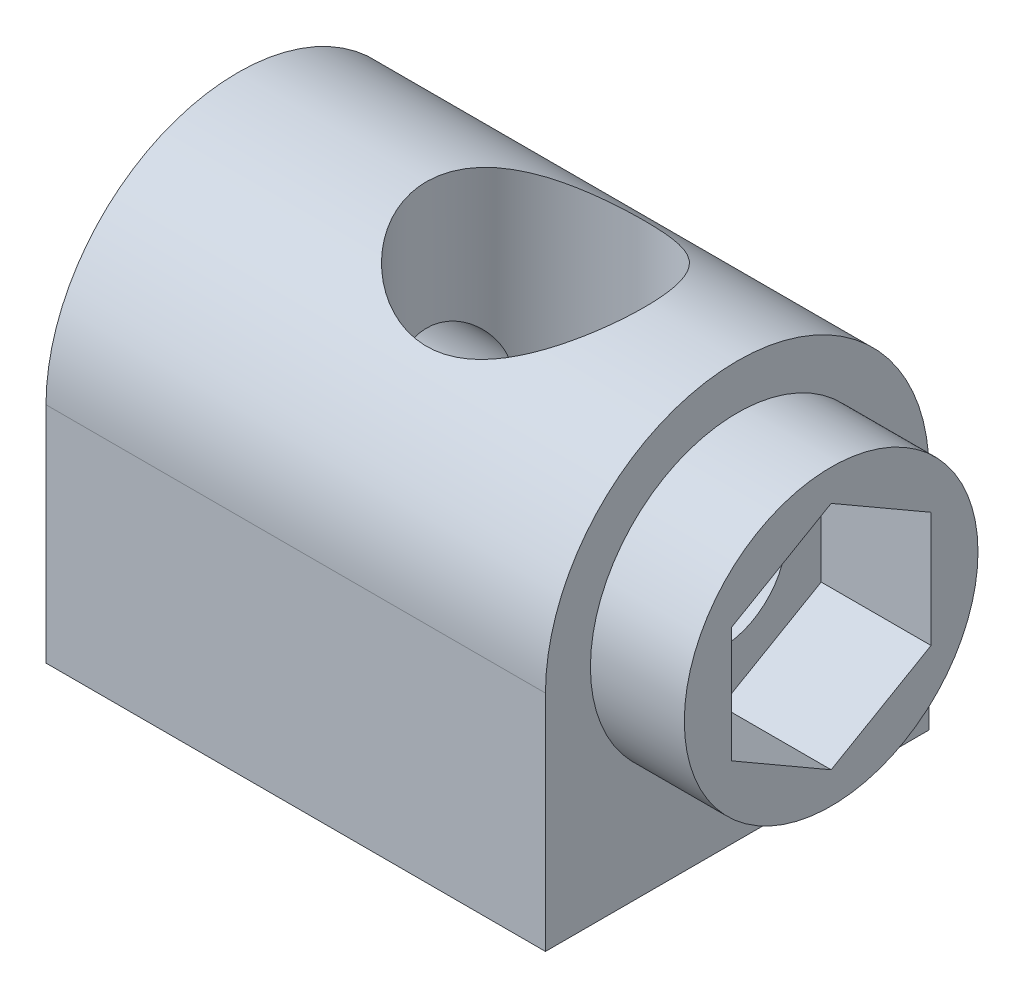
ISO-10303-21;
HEADER;
FILE_DESCRIPTION(('STEP AP214'),'2;1');
FILE_NAME('part.step','',(''),(''),'','','');
FILE_SCHEMA(('AUTOMOTIVE_DESIGN { 1 0 10303 214 1 1 1 1 }'));
ENDSEC;
DATA;
#1=APPLICATION_CONTEXT('core data for automotive mechanical design processes');
#2=APPLICATION_PROTOCOL_DEFINITION('international standard','automotive_design',2000,#1);
#3=PRODUCT_CONTEXT('',#1,'mechanical');
#4=PRODUCT('Part','Part','',(#3));
#5=PRODUCT_RELATED_PRODUCT_CATEGORY('part','',(#4));
#6=PRODUCT_DEFINITION_FORMATION('','',#4);
#7=PRODUCT_DEFINITION_CONTEXT('part definition',#1,'design');
#8=PRODUCT_DEFINITION('design','',#6,#7);
#9=PRODUCT_DEFINITION_SHAPE('','',#8);
#10=(LENGTH_UNIT() NAMED_UNIT(*) SI_UNIT(.MILLI.,.METRE.));
#11=(NAMED_UNIT(*) PLANE_ANGLE_UNIT() SI_UNIT($,.RADIAN.));
#12=(NAMED_UNIT(*) SI_UNIT($,.STERADIAN.) SOLID_ANGLE_UNIT());
#13=UNCERTAINTY_MEASURE_WITH_UNIT(LENGTH_MEASURE(1.E-05),#10,'distance_accuracy_value','');
#14=(GEOMETRIC_REPRESENTATION_CONTEXT(3) GLOBAL_UNCERTAINTY_ASSIGNED_CONTEXT((#13)) GLOBAL_UNIT_ASSIGNED_CONTEXT((#10,
#11,#12)) REPRESENTATION_CONTEXT('',''));
#15=CARTESIAN_POINT('',(0.,0.,0.));
#16=DIRECTION('',(0.,0.,1.));
#17=DIRECTION('',(1.,0.,0.));
#18=AXIS2_PLACEMENT_3D('',#15,#16,#17);
#19=CARTESIAN_POINT('',(25.,0.,9.6));
#20=DIRECTION('',(0.,1.,0.));
#21=DIRECTION('',(0.,0.,1.));
#22=AXIS2_PLACEMENT_3D('',#19,#20,#21);
#23=PLANE('',#22);
#24=DIRECTION('',(0.,0.,-1.));
#25=VECTOR('',#24,1.);
#26=CARTESIAN_POINT('',(3.,0.,4.));
#27=LINE('',#26,#25);
#28=CARTESIAN_POINT('',(3.,0.,4.));
#29=VERTEX_POINT('',#28);
#30=CARTESIAN_POINT('',(3.,0.,-4.));
#31=VERTEX_POINT('',#30);
#32=EDGE_CURVE('E190',#29,#31,#27,.T.);
#33=ORIENTED_EDGE('',*,*,#32,.F.);
#34=DIRECTION('',(-1.,0.,0.));
#35=VECTOR('',#34,1.);
#36=CARTESIAN_POINT('',(3.,0.,4.));
#37=LINE('',#36,#35);
#38=CARTESIAN_POINT('',(11.,0.,4.));
#39=VERTEX_POINT('',#38);
#40=EDGE_CURVE('E203',#39,#29,#37,.T.);
#41=ORIENTED_EDGE('',*,*,#40,.F.);
#42=DIRECTION('',(0.,0.,1.));
#43=VECTOR('',#42,1.);
#44=CARTESIAN_POINT('',(11.,0.,4.));
#45=LINE('',#44,#43);
#46=CARTESIAN_POINT('',(11.,0.,-4.));
#47=VERTEX_POINT('',#46);
#48=EDGE_CURVE('E212',#47,#39,#45,.T.);
#49=ORIENTED_EDGE('',*,*,#48,.F.);
#50=DIRECTION('',(1.,0.,0.));
#51=VECTOR('',#50,1.);
#52=CARTESIAN_POINT('',(3.,0.,-4.));
#53=LINE('',#52,#51);
#54=EDGE_CURVE('E193',#31,#47,#53,.T.);
#55=ORIENTED_EDGE('',*,*,#54,.F.);
#56=EDGE_LOOP('',(#33,#41,#49,#55));
#57=FACE_BOUND('',#56,.T.);
#58=CARTESIAN_POINT('',(14.9,0.,0.));
#59=DIRECTION('',(0.,-1.,0.));
#60=DIRECTION('',(0.,0.,-1.));
#61=AXIS2_PLACEMENT_3D('',#58,#59,#60);
#62=CIRCLE('',#61,3.4);
#63=CARTESIAN_POINT('',(14.9,0.,-3.4));
#64=VERTEX_POINT('',#63);
#65=EDGE_CURVE('E379',#64,#64,#62,.T.);
#66=ORIENTED_EDGE('',*,*,#65,.F.);
#67=EDGE_LOOP('',(#66));
#68=FACE_BOUND('',#67,.T.);
#69=DIRECTION('',(0.,0.,-1.));
#70=VECTOR('',#69,1.);
#71=CARTESIAN_POINT('',(0.,0.,9.6));
#72=LINE('',#71,#70);
#73=CARTESIAN_POINT('',(0.,0.,9.6));
#74=VERTEX_POINT('',#73);
#75=CARTESIAN_POINT('',(0.,0.,-9.6));
#76=VERTEX_POINT('',#75);
#77=EDGE_CURVE('E340',#74,#76,#72,.T.);
#78=ORIENTED_EDGE('',*,*,#77,.T.);
#79=DIRECTION('',(-1.,0.,0.));
#80=VECTOR('',#79,1.);
#81=CARTESIAN_POINT('',(25.,0.,-9.6));
#82=LINE('',#81,#80);
#83=CARTESIAN_POINT('',(25.,0.,-9.6));
#84=VERTEX_POINT('',#83);
#85=EDGE_CURVE('E347',#84,#76,#82,.T.);
#86=ORIENTED_EDGE('',*,*,#85,.F.);
#87=DIRECTION('',(0.,0.,-1.));
#88=VECTOR('',#87,1.);
#89=CARTESIAN_POINT('',(25.,0.,9.6));
#90=LINE('',#89,#88);
#91=CARTESIAN_POINT('',(25.,0.,9.6));
#92=VERTEX_POINT('',#91);
#93=EDGE_CURVE('E346',#92,#84,#90,.T.);
#94=ORIENTED_EDGE('',*,*,#93,.F.);
#95=DIRECTION('',(-1.,0.,0.));
#96=VECTOR('',#95,1.);
#97=CARTESIAN_POINT('',(25.,0.,9.6));
#98=LINE('',#97,#96);
#99=EDGE_CURVE('E334',#92,#74,#98,.T.);
#100=ORIENTED_EDGE('',*,*,#99,.T.);
#101=EDGE_LOOP('',(#78,#86,#94,#100));
#102=FACE_BOUND('',#101,.T.);
#103=DIRECTION('',(0.,0.,-1.));
#104=VECTOR('',#103,1.);
#105=CARTESIAN_POINT('',(19.,0.,4.));
#106=LINE('',#105,#104);
#107=CARTESIAN_POINT('',(19.,0.,4.));
#108=VERTEX_POINT('',#107);
#109=CARTESIAN_POINT('',(19.,0.,-4.));
#110=VERTEX_POINT('',#109);
#111=EDGE_CURVE('E189',#108,#110,#106,.T.);
#112=ORIENTED_EDGE('',*,*,#111,.F.);
#113=DIRECTION('',(-1.,0.,0.));
#114=VECTOR('',#113,1.);
#115=CARTESIAN_POINT('',(19.,0.,4.));
#116=LINE('',#115,#114);
#117=CARTESIAN_POINT('',(21.8,0.,4.));
#118=VERTEX_POINT('',#117);
#119=EDGE_CURVE('E186',#118,#108,#116,.T.);
#120=ORIENTED_EDGE('',*,*,#119,.F.);
#121=DIRECTION('',(0.,0.,1.));
#122=VECTOR('',#121,1.);
#123=CARTESIAN_POINT('',(21.8,0.,4.));
#124=LINE('',#123,#122);
#125=CARTESIAN_POINT('',(21.8,0.,-4.));
#126=VERTEX_POINT('',#125);
#127=EDGE_CURVE('E64',#126,#118,#124,.T.);
#128=ORIENTED_EDGE('',*,*,#127,.F.);
#129=DIRECTION('',(1.,0.,0.));
#130=VECTOR('',#129,1.);
#131=CARTESIAN_POINT('',(19.,0.,-4.));
#132=LINE('',#131,#130);
#133=EDGE_CURVE('E59',#110,#126,#132,.T.);
#134=ORIENTED_EDGE('',*,*,#133,.F.);
#135=EDGE_LOOP('',(#112,#120,#128,#134));
#136=FACE_BOUND('',#135,.T.);
#137=ADVANCED_FACE('F37',(#57,#68,#102,#136),#23,.F.);
#138=CARTESIAN_POINT('',(29.7,11.2,0.));
#139=DIRECTION('',(-1.,0.,0.));
#140=DIRECTION('',(0.,0.,1.));
#141=AXIS2_PLACEMENT_3D('',#138,#139,#140);
#142=CYLINDRICAL_SURFACE('',#141,3.25);
#143=CARTESIAN_POINT('',(19.2749285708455,11.2,3.25));
#144=CARTESIAN_POINT('',(19.2749279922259,11.2818703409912,3.25000040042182));
#145=CARTESIAN_POINT('',(19.2772351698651,11.3637361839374,3.2469018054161));
#146=CARTESIAN_POINT('',(19.286360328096,11.5267799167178,3.23456361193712));
#147=CARTESIAN_POINT('',(19.293180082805,11.6079575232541,3.22532159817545));
#148=CARTESIAN_POINT('',(19.3110451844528,11.7689675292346,3.20084502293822));
#149=CARTESIAN_POINT('',(19.3220925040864,11.8487992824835,3.18560766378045));
#150=CARTESIAN_POINT('',(19.34796906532,12.0065330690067,3.14937518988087));
#151=CARTESIAN_POINT('',(19.36280009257,12.0844341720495,3.12837735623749));
#152=CARTESIAN_POINT('',(19.4119280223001,12.3133472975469,3.05749971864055));
#153=CARTESIAN_POINT('',(19.4510232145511,12.4609060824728,2.99952608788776));
#154=CARTESIAN_POINT('',(19.5374250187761,12.7440147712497,2.86412627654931));
#155=CARTESIAN_POINT('',(19.5847341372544,12.8795609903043,2.78669415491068));
#156=CARTESIAN_POINT('',(19.6891417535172,13.1528665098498,2.60365031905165));
#157=CARTESIAN_POINT('',(19.7467327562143,13.28892102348,2.49576626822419));
#158=CARTESIAN_POINT('',(19.8612547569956,13.542401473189,2.25958661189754));
#159=CARTESIAN_POINT('',(19.9181852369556,13.6598135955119,2.13127601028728));
#160=CARTESIAN_POINT('',(20.0321784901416,13.8850850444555,1.84117132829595));
#161=CARTESIAN_POINT('',(20.0886128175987,13.9906044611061,1.67726823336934));
#162=CARTESIAN_POINT('',(20.1633182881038,14.126418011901,1.41710504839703));
#163=CARTESIAN_POINT('',(20.1865680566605,14.1679542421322,1.32796963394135));
#164=CARTESIAN_POINT('',(20.2290779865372,14.2430307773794,1.14550143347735));
#165=CARTESIAN_POINT('',(20.2483407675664,14.2765763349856,1.05217145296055));
#166=CARTESIAN_POINT('',(20.2806586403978,14.332403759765,0.871016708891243));
#167=CARTESIAN_POINT('',(20.2941271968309,14.355448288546,0.783499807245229));
#168=CARTESIAN_POINT('',(20.3168977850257,14.3942179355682,0.606370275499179));
#169=CARTESIAN_POINT('',(20.3262021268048,14.4099471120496,0.516758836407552));
#170=CARTESIAN_POINT('',(20.340371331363,14.4338420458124,0.336224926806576));
#171=CARTESIAN_POINT('',(20.3452385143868,14.442011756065,0.245303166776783));
#172=CARTESIAN_POINT('',(20.3504005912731,14.4506727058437,0.062996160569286));
#173=CARTESIAN_POINT('',(20.3506959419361,14.4511647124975,-0.0283890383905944));
#174=CARTESIAN_POINT('',(20.3451653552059,14.4418954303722,-0.279558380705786));
#175=CARTESIAN_POINT('',(20.3345630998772,14.4241352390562,-0.439035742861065));
#176=CARTESIAN_POINT('',(20.3001526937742,14.3657838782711,-0.752154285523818));
#177=CARTESIAN_POINT('',(20.2763435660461,14.3251910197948,-0.905795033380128));
#178=CARTESIAN_POINT('',(20.2174152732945,14.2226930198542,-1.20454209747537));
#179=CARTESIAN_POINT('',(20.182226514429,14.1606565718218,-1.34958922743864));
#180=CARTESIAN_POINT('',(20.1033622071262,14.0175413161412,-1.62739400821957));
#181=CARTESIAN_POINT('',(20.0596844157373,13.936457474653,-1.76014839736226));
#182=CARTESIAN_POINT('',(19.9614505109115,13.746693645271,-2.0264926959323));
#183=CARTESIAN_POINT('',(19.9062185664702,13.6358807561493,-2.15831247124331));
#184=CARTESIAN_POINT('',(19.7936809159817,13.3953188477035,-2.40260742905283));
#185=CARTESIAN_POINT('',(19.7363725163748,13.2655445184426,-2.51505631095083));
#186=CARTESIAN_POINT('',(19.6185240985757,12.9732398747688,-2.73033396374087));
#187=CARTESIAN_POINT('',(19.5583581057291,12.8086626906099,-2.83061308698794));
#188=CARTESIAN_POINT('',(19.450124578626,12.4612073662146,-3.00152600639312));
#189=CARTESIAN_POINT('',(19.4020348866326,12.2783636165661,-3.0722142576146));
#190=CARTESIAN_POINT('',(19.3357826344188,11.9455501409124,-3.16682986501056));
#191=CARTESIAN_POINT('',(19.3131726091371,11.7985184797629,-3.19797420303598));
#192=CARTESIAN_POINT('',(19.2827099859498,11.5001198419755,-3.23960680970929));
#193=CARTESIAN_POINT('',(19.2748406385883,11.3487579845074,-3.2501185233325));
#194=CARTESIAN_POINT('',(19.2750181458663,11.0458751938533,-3.2498792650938));
#195=CARTESIAN_POINT('',(19.2830852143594,10.8943543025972,-3.23910128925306));
#196=CARTESIAN_POINT('',(19.3139570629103,10.5957265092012,-3.19689491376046));
#197=CARTESIAN_POINT('',(19.3367733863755,10.4486231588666,-3.16545033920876));
#198=CARTESIAN_POINT('',(19.3941296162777,10.1622349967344,-3.08346728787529));
#199=CARTESIAN_POINT('',(19.4286781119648,10.0229560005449,-3.03291481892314));
#200=CARTESIAN_POINT('',(19.5057786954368,9.75439244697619,-2.91449628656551));
#201=CARTESIAN_POINT('',(19.5483338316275,9.62511172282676,-2.84662362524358));
#202=CARTESIAN_POINT('',(19.6458194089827,9.35574425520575,-2.68149744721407));
#203=CARTESIAN_POINT('',(19.7016026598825,9.21785131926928,-2.58116151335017));
#204=CARTESIAN_POINT('',(19.8139062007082,8.959458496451,-2.36038558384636));
#205=CARTESIAN_POINT('',(19.8704271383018,8.83897519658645,-2.23992664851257));
#206=CARTESIAN_POINT('',(19.9862700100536,8.60347424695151,-1.96401559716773));
#207=CARTESIAN_POINT('',(20.0450488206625,8.49105406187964,-1.80606726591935));
#208=CARTESIAN_POINT('',(20.1244790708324,8.34397854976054,-1.5540707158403));
#209=CARTESIAN_POINT('',(20.1495074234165,8.29853253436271,-1.4675233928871));
#210=CARTESIAN_POINT('',(20.1959468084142,8.21533079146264,-1.28990205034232));
#211=CARTESIAN_POINT('',(20.2173601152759,8.1775702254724,-1.19883092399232));
#212=CARTESIAN_POINT('',(20.2544844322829,8.11274316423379,-1.01967801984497));
#213=CARTESIAN_POINT('',(20.2704991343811,8.08509413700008,-0.931869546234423));
#214=CARTESIAN_POINT('',(20.2983925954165,8.03724474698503,-0.753648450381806));
#215=CARTESIAN_POINT('',(20.3102736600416,8.01704023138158,-0.663237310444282));
#216=CARTESIAN_POINT('',(20.3295431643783,7.98439518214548,-0.480603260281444));
#217=CARTESIAN_POINT('',(20.3369345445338,7.97194956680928,-0.38838157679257));
#218=CARTESIAN_POINT('',(20.3470114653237,7.95500781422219,-0.202989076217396));
#219=CARTESIAN_POINT('',(20.3496975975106,7.95051067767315,-0.109818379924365));
#220=CARTESIAN_POINT('',(20.3504559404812,7.94922922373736,0.145271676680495));
#221=CARTESIAN_POINT('',(20.3436803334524,7.96055244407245,0.307344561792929));
#222=CARTESIAN_POINT('',(20.3162235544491,8.0069120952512,0.626725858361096));
#223=CARTESIAN_POINT('',(20.2955421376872,8.04194894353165,0.784034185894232));
#224=CARTESIAN_POINT('',(20.2425341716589,8.13339980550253,1.08778881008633));
#225=CARTESIAN_POINT('',(20.2103688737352,8.18951834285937,1.23435322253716));
#226=CARTESIAN_POINT('',(20.136925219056,8.32104936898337,1.51602626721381));
#227=CARTESIAN_POINT('',(20.0956447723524,8.3964662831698,1.65113226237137));
#228=CARTESIAN_POINT('',(20.0020962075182,8.57365959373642,1.92192638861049));
#229=CARTESIAN_POINT('',(19.9491209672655,8.67741274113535,2.05607395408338));
#230=CARTESIAN_POINT('',(19.8399415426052,8.90373160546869,2.3061078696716));
#231=CARTESIAN_POINT('',(19.7837337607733,9.02631854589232,2.421973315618));
#232=CARTESIAN_POINT('',(19.665978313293,9.3046306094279,2.64687966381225));
#233=CARTESIAN_POINT('',(19.6046337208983,9.46258027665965,2.75328877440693));
#234=CARTESIAN_POINT('',(19.4915560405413,9.79749227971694,2.93800772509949));
#235=CARTESIAN_POINT('',(19.4398163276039,9.97444137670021,3.01633696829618));
#236=CARTESIAN_POINT('',(19.3780251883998,10.2412558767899,3.10659446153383));
#237=CARTESIAN_POINT('',(19.3607267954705,10.325276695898,3.13130925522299));
#238=CARTESIAN_POINT('',(19.3304562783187,10.4957564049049,3.17399514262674));
#239=CARTESIAN_POINT('',(19.3174815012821,10.582213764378,3.19197037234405));
#240=CARTESIAN_POINT('',(19.2964710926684,10.7567676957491,3.22084801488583));
#241=CARTESIAN_POINT('',(19.2884284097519,10.8448617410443,3.23176052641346));
#242=CARTESIAN_POINT('',(19.2776577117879,11.0219723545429,3.24633596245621));
#243=CARTESIAN_POINT('',(19.2749291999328,11.110988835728,3.24999956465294));
#244=CARTESIAN_POINT('',(19.2749285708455,11.2,3.25));
#245=B_SPLINE_CURVE_WITH_KNOTS('',3,(#143,#144,#145,#146,#147,#148,#149,#150,#151,#152,#153,
#154,#155,#156,#157,#158,#159,#160,#161,#162,#163,#164,#165,#166,#167,#168,#169,#170,#171,#172,
#173,#174,#175,#176,#177,#178,#179,#180,#181,#182,#183,#184,#185,#186,#187,#188,#189,#190,#191,
#192,#193,#194,#195,#196,#197,#198,#199,#200,#201,#202,#203,#204,#205,#206,#207,#208,#209,#210,
#211,#212,#213,#214,#215,#216,#217,#218,#219,#220,#221,#222,#223,#224,#225,#226,#227,#228,#229,
#230,#231,#232,#233,#234,#235,#236,#237,#238,#239,#240,#241,#242,#243,#244),.UNSPECIFIED.,.T.,
.F.,(4,2,2,2,2,2,2,2,2,2,2,2,2,2,2,2,2,2,2,2,2,2,2,2,2,2,2,2,2,2,2,2,2,2,2,2,2,2,2,2,2,2,2,2,2,
2,2,2,2,2,4),(0.,0.245513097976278,0.491122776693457,0.736847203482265,0.982687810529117,
1.47033183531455,1.95812492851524,2.50474989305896,3.05177802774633,3.65691922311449,
3.95967597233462,4.26223315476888,4.53633266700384,4.81027993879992,5.08408387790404,
5.35786045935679,5.83777085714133,6.3177167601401,6.8006551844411,7.28372138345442,
7.82410930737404,8.36522525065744,8.96789892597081,9.56945859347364,10.0234559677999,
10.4769371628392,10.9309939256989,11.3854064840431,11.84015244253,12.295071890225,
12.8312395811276,13.3679147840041,13.9721511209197,14.2745015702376,14.5766610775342,
14.8565818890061,15.136346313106,15.4159273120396,15.6954731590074,16.1806637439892,
16.6658628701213,17.1445009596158,17.6232489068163,18.1541608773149,18.685675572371,
19.2831578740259,19.8802265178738,20.1477260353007,20.4150611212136,20.6820131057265,
20.9489401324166),.UNSPECIFIED.);
#246=CARTESIAN_POINT('',(19.2749285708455,11.2,3.25));
#247=VERTEX_POINT('',#246);
#248=EDGE_CURVE('E238',#247,#247,#245,.T.);
#249=ORIENTED_EDGE('',*,*,#248,.T.);
#250=EDGE_LOOP('',(#249));
#251=FACE_BOUND('',#250,.T.);
#252=CARTESIAN_POINT('',(24.2,11.2,0.));
#253=DIRECTION('',(1.,0.,0.));
#254=DIRECTION('',(0.,0.,-1.));
#255=AXIS2_PLACEMENT_3D('',#252,#253,#254);
#256=CIRCLE('',#255,3.25);
#257=CARTESIAN_POINT('',(24.2,11.2,-3.25));
#258=VERTEX_POINT('',#257);
#259=EDGE_CURVE('E363',#258,#258,#256,.T.);
#260=ORIENTED_EDGE('',*,*,#259,.T.);
#261=EDGE_LOOP('',(#260));
#262=FACE_BOUND('',#261,.T.);
#263=ADVANCED_FACE('F265',(#251,#262),#142,.F.);
#264=CARTESIAN_POINT('',(25.,0.,-9.6));
#265=DIRECTION('',(0.,0.,1.));
#266=DIRECTION('',(0.,-1.,0.));
#267=AXIS2_PLACEMENT_3D('',#264,#265,#266);
#268=PLANE('',#267);
#269=DIRECTION('',(0.,1.,0.));
#270=VECTOR('',#269,1.);
#271=CARTESIAN_POINT('',(0.,0.,-9.6));
#272=LINE('',#271,#270);
#273=CARTESIAN_POINT('',(0.,11.2,-9.6));
#274=VERTEX_POINT('',#273);
#275=EDGE_CURVE('E351',#76,#274,#272,.T.);
#276=ORIENTED_EDGE('',*,*,#275,.T.);
#277=DIRECTION('',(-1.,0.,0.));
#278=VECTOR('',#277,1.);
#279=CARTESIAN_POINT('',(25.,11.2,-9.6));
#280=LINE('',#279,#278);
#281=CARTESIAN_POINT('',(25.,11.2,-9.6));
#282=VERTEX_POINT('',#281);
#283=EDGE_CURVE('E51',#282,#274,#280,.T.);
#284=ORIENTED_EDGE('',*,*,#283,.F.);
#285=DIRECTION('',(0.,1.,0.));
#286=VECTOR('',#285,1.);
#287=CARTESIAN_POINT('',(25.,0.,-9.6));
#288=LINE('',#287,#286);
#289=EDGE_CURVE('E352',#84,#282,#288,.T.);
#290=ORIENTED_EDGE('',*,*,#289,.F.);
#291=ORIENTED_EDGE('',*,*,#85,.T.);
#292=EDGE_LOOP('',(#276,#284,#290,#291));
#293=FACE_BOUND('',#292,.T.);
#294=ADVANCED_FACE('F39',(#293),#268,.F.);
#295=CARTESIAN_POINT('',(25.,11.2,0.));
#296=DIRECTION('',(-1.,0.,0.));
#297=DIRECTION('',(0.,0.,1.));
#298=AXIS2_PLACEMENT_3D('',#295,#296,#297);
#299=CYLINDRICAL_SURFACE('',#298,9.6);
#300=CARTESIAN_POINT('',(9.45,20.8,0.));
#301=CARTESIAN_POINT('',(9.45000115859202,20.7999989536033,-0.140709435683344));
#302=CARTESIAN_POINT('',(9.45545807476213,20.7968981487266,-0.281466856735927));
#303=CARTESIAN_POINT('',(9.4772204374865,20.7845688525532,-0.561933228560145));
#304=CARTESIAN_POINT('',(9.49353292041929,20.7753363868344,-0.701641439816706));
#305=CARTESIAN_POINT('',(9.53683936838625,20.7509513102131,-0.979167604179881));
#306=CARTESIAN_POINT('',(9.56385531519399,20.7357865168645,-1.11698105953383));
#307=CARTESIAN_POINT('',(9.62823987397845,20.6999074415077,-1.38948169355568));
#308=CARTESIAN_POINT('',(9.66561291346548,20.6791907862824,-1.52416750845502));
#309=CARTESIAN_POINT('',(9.75005749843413,20.6328239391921,-1.78879183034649));
#310=CARTESIAN_POINT('',(9.79707736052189,20.6072000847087,-1.91875146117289));
#311=CARTESIAN_POINT('',(9.90045458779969,20.5515275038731,-2.17394194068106));
#312=CARTESIAN_POINT('',(9.95681548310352,20.521477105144,-2.29917097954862));
#313=CARTESIAN_POINT('',(10.1390709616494,20.4256812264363,-2.66658471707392));
#314=CARTESIAN_POINT('',(10.2782509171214,20.3542274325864,-2.90084437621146));
#315=CARTESIAN_POINT('',(10.5990720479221,20.1963668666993,-3.35984451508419));
#316=CARTESIAN_POINT('',(10.7830416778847,20.1092554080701,-3.582699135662));
#317=CARTESIAN_POINT('',(11.1830709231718,19.9316003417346,-3.99623274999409));
#318=CARTESIAN_POINT('',(11.3991678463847,19.8410528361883,-4.18687377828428));
#319=CARTESIAN_POINT('',(11.8849494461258,19.6553280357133,-4.55121438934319));
#320=CARTESIAN_POINT('',(12.1578933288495,19.5606908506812,-4.72092321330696));
#321=CARTESIAN_POINT('',(12.589472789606,19.4326884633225,-4.93861981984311));
#322=CARTESIAN_POINT('',(12.7370095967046,19.3923501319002,-5.0050357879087));
#323=CARTESIAN_POINT('',(13.0388020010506,19.3178948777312,-5.12491523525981));
#324=CARTESIAN_POINT('',(13.1930554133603,19.2837759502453,-5.17838289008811));
#325=CARTESIAN_POINT('',(13.4727688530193,19.2299427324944,-5.2613593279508));
#326=CARTESIAN_POINT('',(13.5971493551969,19.2087100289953,-5.29355055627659));
#327=CARTESIAN_POINT('',(13.8486397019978,19.171662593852,-5.34917892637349));
#328=CARTESIAN_POINT('',(13.975749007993,19.155846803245,-5.37261777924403));
#329=CARTESIAN_POINT('',(14.2317954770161,19.1301821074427,-5.41042842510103));
#330=CARTESIAN_POINT('',(14.3607309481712,19.1203280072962,-5.42480811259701));
#331=CARTESIAN_POINT('',(14.6196327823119,19.1069207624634,-5.44433152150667));
#332=CARTESIAN_POINT('',(14.7495991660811,19.1033677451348,-5.44947505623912));
#333=CARTESIAN_POINT('',(15.0097283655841,19.1026960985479,-5.45044906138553));
#334=CARTESIAN_POINT('',(15.1398912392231,19.1055846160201,-5.44626918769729));
#335=CARTESIAN_POINT('',(15.3993319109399,19.1177036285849,-5.42863536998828));
#336=CARTESIAN_POINT('',(15.5286093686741,19.1269364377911,-5.41517804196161));
#337=CARTESIAN_POINT('',(15.785340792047,19.1514150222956,-5.37917024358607));
#338=CARTESIAN_POINT('',(15.9127943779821,19.1666620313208,-5.35661790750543));
#339=CARTESIAN_POINT('',(16.165057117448,19.2026400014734,-5.3027156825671));
#340=CARTESIAN_POINT('',(16.2898651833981,19.2233731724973,-5.27136224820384));
#341=CARTESIAN_POINT('',(16.658411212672,19.2926866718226,-5.16484607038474));
#342=CARTESIAN_POINT('',(16.8972802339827,19.348485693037,-5.07708232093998));
#343=CARTESIAN_POINT('',(17.3575290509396,19.4733085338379,-4.87101671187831));
#344=CARTESIAN_POINT('',(17.578902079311,19.5423374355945,-4.75270311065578));
#345=CARTESIAN_POINT('',(18.0352281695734,19.6990734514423,-4.46724511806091));
#346=CARTESIAN_POINT('',(18.2667826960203,19.7880074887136,-4.29533544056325));
#347=CARTESIAN_POINT('',(18.7000207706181,19.9669074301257,-3.91727243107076));
#348=CARTESIAN_POINT('',(18.9016790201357,20.0568741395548,-3.71109040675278));
#349=CARTESIAN_POINT('',(19.1889848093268,20.1913687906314,-3.36642745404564));
#350=CARTESIAN_POINT('',(19.2863914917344,20.2383383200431,-3.23852492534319));
#351=CARTESIAN_POINT('',(19.4700033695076,20.3288576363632,-2.97380081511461));
#352=CARTESIAN_POINT('',(19.5562127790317,20.3724087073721,-2.83698261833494));
#353=CARTESIAN_POINT('',(19.7166171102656,20.4548674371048,-2.55518706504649));
#354=CARTESIAN_POINT('',(19.7908148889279,20.4937761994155,-2.41021165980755));
#355=CARTESIAN_POINT('',(19.9263705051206,20.565820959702,-2.11299891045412));
#356=CARTESIAN_POINT('',(19.9877299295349,20.5989576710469,-1.96076246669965));
#357=CARTESIAN_POINT('',(20.0929855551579,20.656362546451,-1.66098017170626));
#358=CARTESIAN_POINT('',(20.1377992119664,20.6810870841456,-1.51384392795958));
#359=CARTESIAN_POINT('',(20.2149809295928,20.7239430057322,-1.2154107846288));
#360=CARTESIAN_POINT('',(20.2473507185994,20.7420753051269,-1.06411446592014));
#361=CARTESIAN_POINT('',(20.2991436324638,20.7711960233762,-0.758756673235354));
#362=CARTESIAN_POINT('',(20.3185764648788,20.7821897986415,-0.604697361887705));
#363=CARTESIAN_POINT('',(20.3442176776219,20.796712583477,-0.295137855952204));
#364=CARTESIAN_POINT('',(20.3504274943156,20.8002424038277,-0.139637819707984));
#365=CARTESIAN_POINT('',(20.3495804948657,20.7997620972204,0.15267249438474));
#366=CARTESIAN_POINT('',(20.3440230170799,20.7966040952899,0.289491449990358));
#367=CARTESIAN_POINT('',(20.3226585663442,20.7845003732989,0.562113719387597));
#368=CARTESIAN_POINT('',(20.3068484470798,20.7755528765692,0.69791670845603));
#369=CARTESIAN_POINT('',(20.2651818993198,20.752087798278,0.967424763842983));
#370=CARTESIAN_POINT('',(20.2393293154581,20.7375723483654,1.10113061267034));
#371=CARTESIAN_POINT('',(20.1778745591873,20.7033052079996,1.36564499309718));
#372=CARTESIAN_POINT('',(20.1422686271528,20.6835514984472,1.49645238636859));
#373=CARTESIAN_POINT('',(20.0620637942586,20.639453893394,1.75314273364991));
#374=CARTESIAN_POINT('',(20.0175496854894,20.6151534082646,1.87905966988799));
#375=CARTESIAN_POINT('',(19.9197604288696,20.5623612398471,2.12655434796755));
#376=CARTESIAN_POINT('',(19.866482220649,20.533868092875,2.24813055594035));
#377=CARTESIAN_POINT('',(19.6941870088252,20.4429515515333,2.60539435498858));
#378=CARTESIAN_POINT('',(19.5626526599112,20.3750589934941,2.8337966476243));
#379=CARTESIAN_POINT('',(19.2547373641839,20.222279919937,3.28971915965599));
#380=CARTESIAN_POINT('',(19.0751163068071,20.1363605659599,3.51468072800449));
#381=CARTESIAN_POINT('',(18.6835300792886,19.9602507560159,3.93313423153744));
#382=CARTESIAN_POINT('',(18.4715281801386,19.8700555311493,4.12658990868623));
#383=CARTESIAN_POINT('',(18.1198172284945,19.7329593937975,4.40006573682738));
#384=CARTESIAN_POINT('',(17.9899255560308,19.6846553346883,4.49225259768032));
#385=CARTESIAN_POINT('',(17.7218035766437,19.5907273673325,4.6653376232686));
#386=CARTESIAN_POINT('',(17.58357121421,19.5451041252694,4.74623298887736));
#387=CARTESIAN_POINT('',(17.2995921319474,19.458165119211,4.89593743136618));
#388=CARTESIAN_POINT('',(17.1538526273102,19.4168453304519,4.96475784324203));
#389=CARTESIAN_POINT('',(16.8555953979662,19.3400936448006,5.08962166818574));
#390=CARTESIAN_POINT('',(16.7030826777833,19.3046574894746,5.14567433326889));
#391=CARTESIAN_POINT('',(16.4252324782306,19.2479474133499,5.2338010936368));
#392=CARTESIAN_POINT('',(16.3009908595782,19.2252637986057,5.26843942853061));
#393=CARTESIAN_POINT('',(16.0496000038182,19.1852175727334,5.32894167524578));
#394=CARTESIAN_POINT('',(15.9224523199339,19.1678521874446,5.35481016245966));
#395=CARTESIAN_POINT('',(15.6660729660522,19.1390275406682,5.39745366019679));
#396=CARTESIAN_POINT('',(15.5368429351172,19.1275638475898,5.414235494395));
#397=CARTESIAN_POINT('',(15.2771023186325,19.1109362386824,5.43850217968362));
#398=CARTESIAN_POINT('',(15.1465917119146,19.1057724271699,5.44598687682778));
#399=CARTESIAN_POINT('',(14.8850581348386,19.1019365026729,5.45155130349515));
#400=CARTESIAN_POINT('',(14.7540346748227,19.1032750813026,5.44961554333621));
#401=CARTESIAN_POINT('',(14.4926489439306,19.1124183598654,5.43633140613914));
#402=CARTESIAN_POINT('',(14.3622869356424,19.1202254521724,5.42497954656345));
#403=CARTESIAN_POINT('',(14.1032042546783,19.1420226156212,5.39301870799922));
#404=CARTESIAN_POINT('',(13.9744838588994,19.1560137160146,5.37240818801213));
#405=CARTESIAN_POINT('',(13.7195435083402,19.1896791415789,5.32221098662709));
#406=CARTESIAN_POINT('',(13.5933245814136,19.2093557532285,5.29262069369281));
#407=CARTESIAN_POINT('',(13.2231279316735,19.2753436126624,5.19184663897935));
#408=CARTESIAN_POINT('',(12.9837288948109,19.3289726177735,5.10816435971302));
#409=CARTESIAN_POINT('',(12.5218821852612,19.4500315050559,4.91022991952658));
#410=CARTESIAN_POINT('',(12.2994408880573,19.5174665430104,4.79596633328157));
#411=CARTESIAN_POINT('',(11.8413473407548,19.6710929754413,4.51986812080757));
#412=CARTESIAN_POINT('',(11.6089040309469,19.7585747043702,4.35342464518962));
#413=CARTESIAN_POINT('',(11.1729646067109,19.9354753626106,3.98658927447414));
#414=CARTESIAN_POINT('',(10.969493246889,20.0248958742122,3.78616866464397));
#415=CARTESIAN_POINT('',(10.6776866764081,20.1597345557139,3.44966239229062));
#416=CARTESIAN_POINT('',(10.5780568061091,20.2072164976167,3.32402376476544));
#417=CARTESIAN_POINT('',(10.3897933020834,20.2990495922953,3.06370887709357));
#418=CARTESIAN_POINT('',(10.3011556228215,20.3434018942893,2.92903597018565));
#419=CARTESIAN_POINT('',(10.1356606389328,20.4277496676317,2.65135741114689));
#420=CARTESIAN_POINT('',(10.0588022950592,20.4677455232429,2.5083524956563));
#421=CARTESIAN_POINT('',(9.91770667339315,20.542224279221,2.21489045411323));
#422=CARTESIAN_POINT('',(9.85346591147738,20.5767087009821,2.06443539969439));
#423=CARTESIAN_POINT('',(9.74863276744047,20.6335841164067,1.78441520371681));
#424=CARTESIAN_POINT('',(9.7058669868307,20.6570352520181,1.65587467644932));
#425=CARTESIAN_POINT('',(9.62987037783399,20.698987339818,1.3952247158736));
#426=CARTESIAN_POINT('',(9.59663787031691,20.7174891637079,1.26311591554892));
#427=CARTESIAN_POINT('',(9.54014779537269,20.7490821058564,0.99649913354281));
#428=CARTESIAN_POINT('',(9.51686544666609,20.762186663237,0.861997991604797));
#429=CARTESIAN_POINT('',(9.48044705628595,20.7827358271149,0.591254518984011));
#430=CARTESIAN_POINT('',(9.4673050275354,20.790183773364,0.455013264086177));
#431=CARTESIAN_POINT('',(9.45620798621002,20.7964768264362,0.265425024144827));
#432=CARTESIAN_POINT('',(9.45388084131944,20.7977972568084,0.212380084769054));
#433=CARTESIAN_POINT('',(9.45077655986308,20.799559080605,0.106225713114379));
#434=CARTESIAN_POINT('',(9.44999956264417,20.8000003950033,0.0531162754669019));
#435=CARTESIAN_POINT('',(9.45,20.8,0.));
#436=B_SPLINE_CURVE_WITH_KNOTS('',3,(#300,#301,#302,#303,#304,#305,#306,#307,#308,#309,#310,
#311,#312,#313,#314,#315,#316,#317,#318,#319,#320,#321,#322,#323,#324,#325,#326,#327,#328,#329,
#330,#331,#332,#333,#334,#335,#336,#337,#338,#339,#340,#341,#342,#343,#344,#345,#346,#347,#348,
#349,#350,#351,#352,#353,#354,#355,#356,#357,#358,#359,#360,#361,#362,#363,#364,#365,#366,#367,
#368,#369,#370,#371,#372,#373,#374,#375,#376,#377,#378,#379,#380,#381,#382,#383,#384,#385,#386,
#387,#388,#389,#390,#391,#392,#393,#394,#395,#396,#397,#398,#399,#400,#401,#402,#403,#404,#405,
#406,#407,#408,#409,#410,#411,#412,#413,#414,#415,#416,#417,#418,#419,#420,#421,#422,#423,#424,
#425,#426,#427,#428,#429,#430,#431,#432,#433,#434,#435),.UNSPECIFIED.,.T.,.F.,(4,2,2,2,2,2,2,2,
2,2,2,2,2,2,2,2,2,2,2,2,2,2,2,2,2,2,2,2,2,2,2,2,2,2,2,2,2,2,2,2,2,2,2,2,2,2,2,2,2,2,2,2,2,2,2,2,
2,2,2,2,2,2,2,2,2,2,2,4),(0.,0.422072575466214,0.844418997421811,1.26763732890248,
1.69103686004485,2.11222461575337,2.53357190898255,3.37516439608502,4.27708014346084,
5.18005154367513,6.17956853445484,6.67922023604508,7.17871059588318,7.56897861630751,
7.9591702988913,8.34902148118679,8.738880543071,9.12917235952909,9.51960661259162,
9.91012099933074,10.3007929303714,11.0790972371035,11.8577011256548,12.7595703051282,
13.6621983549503,14.164123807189,14.6658598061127,15.1674762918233,15.6690307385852,
16.135719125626,16.6023426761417,17.0686156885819,17.5348380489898,17.945241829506,
18.3557716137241,18.7661443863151,19.1766755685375,19.5834705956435,19.9904079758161,
20.8037158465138,21.7015491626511,22.6004085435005,23.0992290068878,23.5981729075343,
24.0966459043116,24.5947565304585,24.9872347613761,25.3795079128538,25.771486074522,
26.1634707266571,26.5561001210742,26.9488747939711,27.3417148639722,27.7347131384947,
28.509059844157,29.2836962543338,30.1771775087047,31.0714176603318,31.5725677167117,
32.0735327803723,32.5744536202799,33.0752359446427,33.487248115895,33.899187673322,
34.3100952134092,34.7207599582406,34.8800734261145,35.0394012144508),.UNSPECIFIED.);
#437=CARTESIAN_POINT('',(9.45,20.8,0.));
#438=VERTEX_POINT('',#437);
#439=EDGE_CURVE('E232',#438,#438,#436,.T.);
#440=ORIENTED_EDGE('',*,*,#439,.T.);
#441=EDGE_LOOP('',(#440));
#442=FACE_BOUND('',#441,.T.);
#443=CARTESIAN_POINT('',(0.,11.2,0.));
#444=DIRECTION('',(1.,0.,0.));
#445=DIRECTION('',(0.,0.,-1.));
#446=AXIS2_PLACEMENT_3D('',#443,#444,#445);
#447=CIRCLE('',#446,9.6);
#448=CARTESIAN_POINT('',(0.,11.2,9.6));
#449=VERTEX_POINT('',#448);
#450=EDGE_CURVE('E341',#274,#449,#447,.T.);
#451=ORIENTED_EDGE('',*,*,#450,.T.);
#452=DIRECTION('',(-1.,0.,0.));
#453=VECTOR('',#452,1.);
#454=CARTESIAN_POINT('',(25.,11.2,9.6));
#455=LINE('',#454,#453);
#456=CARTESIAN_POINT('',(25.,11.2,9.6));
#457=VERTEX_POINT('',#456);
#458=EDGE_CURVE('E337',#457,#449,#455,.T.);
#459=ORIENTED_EDGE('',*,*,#458,.F.);
#460=CARTESIAN_POINT('',(25.,11.2,0.));
#461=DIRECTION('',(1.,0.,0.));
#462=DIRECTION('',(0.,0.,-1.));
#463=AXIS2_PLACEMENT_3D('',#460,#461,#462);
#464=CIRCLE('',#463,9.6);
#465=EDGE_CURVE('E355',#282,#457,#464,.T.);
#466=ORIENTED_EDGE('',*,*,#465,.F.);
#467=ORIENTED_EDGE('',*,*,#283,.T.);
#468=EDGE_LOOP('',(#451,#459,#466,#467));
#469=FACE_BOUND('',#468,.T.);
#470=ADVANCED_FACE('F243',(#442,#469),#299,.T.);
#471=CARTESIAN_POINT('',(25.,11.2,9.6));
#472=DIRECTION('',(0.,0.,-1.));
#473=DIRECTION('',(0.,1.,0.));
#474=AXIS2_PLACEMENT_3D('',#471,#472,#473);
#475=PLANE('',#474);
#476=DIRECTION('',(0.,-1.,0.));
#477=VECTOR('',#476,1.);
#478=CARTESIAN_POINT('',(0.,11.2,9.6));
#479=LINE('',#478,#477);
#480=EDGE_CURVE('E331',#449,#74,#479,.T.);
#481=ORIENTED_EDGE('',*,*,#480,.T.);
#482=ORIENTED_EDGE('',*,*,#99,.F.);
#483=DIRECTION('',(0.,-1.,0.));
#484=VECTOR('',#483,1.);
#485=CARTESIAN_POINT('',(25.,11.2,9.6));
#486=LINE('',#485,#484);
#487=EDGE_CURVE('E443',#457,#92,#486,.T.);
#488=ORIENTED_EDGE('',*,*,#487,.F.);
#489=ORIENTED_EDGE('',*,*,#458,.T.);
#490=EDGE_LOOP('',(#481,#482,#488,#489));
#491=FACE_BOUND('',#490,.T.);
#492=ADVANCED_FACE('F314',(#491),#475,.F.);
#493=CARTESIAN_POINT('',(25.,11.2,0.));
#494=DIRECTION('',(1.,0.,0.));
#495=DIRECTION('',(0.,0.,-1.));
#496=AXIS2_PLACEMENT_3D('',#493,#494,#495);
#497=PLANE('',#496);
#498=CARTESIAN_POINT('',(25.,11.2,0.));
#499=DIRECTION('',(1.,0.,0.));
#500=DIRECTION('',(0.,0.,-1.));
#501=AXIS2_PLACEMENT_3D('',#498,#499,#500);
#502=CIRCLE('',#501,7.35);
#503=CARTESIAN_POINT('',(25.,11.2,-7.35));
#504=VERTEX_POINT('',#503);
#505=EDGE_CURVE('E11',#504,#504,#502,.T.);
#506=ORIENTED_EDGE('',*,*,#505,.F.);
#507=EDGE_LOOP('',(#506));
#508=FACE_BOUND('',#507,.T.);
#509=ORIENTED_EDGE('',*,*,#289,.T.);
#510=ORIENTED_EDGE('',*,*,#465,.T.);
#511=ORIENTED_EDGE('',*,*,#487,.T.);
#512=ORIENTED_EDGE('',*,*,#93,.T.);
#513=EDGE_LOOP('',(#509,#510,#511,#512));
#514=FACE_BOUND('',#513,.T.);
#515=ADVANCED_FACE('F311',(#508,#514),#497,.T.);
#516=CARTESIAN_POINT('',(0.,11.2,0.));
#517=DIRECTION('',(1.,0.,0.));
#518=DIRECTION('',(0.,0.,-1.));
#519=AXIS2_PLACEMENT_3D('',#516,#517,#518);
#520=PLANE('',#519);
#521=CARTESIAN_POINT('',(0.,11.2,0.));
#522=DIRECTION('',(-1.,0.,0.));
#523=DIRECTION('',(0.,0.,1.));
#524=AXIS2_PLACEMENT_3D('',#521,#522,#523);
#525=CIRCLE('',#524,4.9);
#526=CARTESIAN_POINT('',(0.,11.2,4.9));
#527=VERTEX_POINT('',#526);
#528=EDGE_CURVE('E423',#527,#527,#525,.T.);
#529=ORIENTED_EDGE('',*,*,#528,.F.);
#530=EDGE_LOOP('',(#529));
#531=FACE_BOUND('',#530,.T.);
#532=ORIENTED_EDGE('',*,*,#275,.F.);
#533=ORIENTED_EDGE('',*,*,#77,.F.);
#534=ORIENTED_EDGE('',*,*,#480,.F.);
#535=ORIENTED_EDGE('',*,*,#450,.F.);
#536=EDGE_LOOP('',(#532,#533,#534,#535));
#537=FACE_BOUND('',#536,.T.);
#538=ADVANCED_FACE('F309',(#531,#537),#520,.F.);
#539=CARTESIAN_POINT('',(29.7,11.2,0.));
#540=DIRECTION('',(-1.,0.,0.));
#541=DIRECTION('',(0.,0.,1.));
#542=AXIS2_PLACEMENT_3D('',#539,#540,#541);
#543=CYLINDRICAL_SURFACE('',#542,7.35);
#544=CARTESIAN_POINT('',(29.7,11.2,0.));
#545=DIRECTION('',(1.,0.,0.));
#546=DIRECTION('',(0.,0.,-1.));
#547=AXIS2_PLACEMENT_3D('',#544,#545,#546);
#548=CIRCLE('',#547,7.35);
#549=CARTESIAN_POINT('',(29.7,11.2,-7.35));
#550=VERTEX_POINT('',#549);
#551=EDGE_CURVE('E437',#550,#550,#548,.T.);
#552=ORIENTED_EDGE('',*,*,#551,.F.);
#553=EDGE_LOOP('',(#552));
#554=FACE_BOUND('',#553,.T.);
#555=ORIENTED_EDGE('',*,*,#505,.T.);
#556=EDGE_LOOP('',(#555));
#557=FACE_BOUND('',#556,.T.);
#558=ADVANCED_FACE('F305',(#554,#557),#543,.T.);
#559=CARTESIAN_POINT('',(29.7,11.2,0.));
#560=DIRECTION('',(1.,0.,0.));
#561=DIRECTION('',(0.,0.,-1.));
#562=AXIS2_PLACEMENT_3D('',#559,#560,#561);
#563=PLANE('',#562);
#564=DIRECTION('',(0.,-0.5,-0.866025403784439));
#565=VECTOR('',#564,1.);
#566=CARTESIAN_POINT('',(29.7,8.31324865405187,5.));
#567=LINE('',#566,#565);
#568=CARTESIAN_POINT('',(29.7,8.31324865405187,5.));
#569=VERTEX_POINT('',#568);
#570=CARTESIAN_POINT('',(29.7,5.42649730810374,0.));
#571=VERTEX_POINT('',#570);
#572=EDGE_CURVE('E365',#569,#571,#567,.T.);
#573=ORIENTED_EDGE('',*,*,#572,.F.);
#574=DIRECTION('',(0.,-1.,0.));
#575=VECTOR('',#574,1.);
#576=CARTESIAN_POINT('',(29.7,14.0867513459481,5.));
#577=LINE('',#576,#575);
#578=CARTESIAN_POINT('',(29.7,14.0867513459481,5.));
#579=VERTEX_POINT('',#578);
#580=EDGE_CURVE('E390',#579,#569,#577,.T.);
#581=ORIENTED_EDGE('',*,*,#580,.F.);
#582=DIRECTION('',(0.,-0.5,0.866025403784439));
#583=VECTOR('',#582,1.);
#584=CARTESIAN_POINT('',(29.7,16.9735026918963,0.));
#585=LINE('',#584,#583);
#586=CARTESIAN_POINT('',(29.7,16.9735026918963,0.));
#587=VERTEX_POINT('',#586);
#588=EDGE_CURVE('E416',#587,#579,#585,.T.);
#589=ORIENTED_EDGE('',*,*,#588,.F.);
#590=DIRECTION('',(0.,0.5,0.866025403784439));
#591=VECTOR('',#590,1.);
#592=CARTESIAN_POINT('',(29.7,14.0867513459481,-5.));
#593=LINE('',#592,#591);
#594=CARTESIAN_POINT('',(29.7,14.0867513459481,-5.));
#595=VERTEX_POINT('',#594);
#596=EDGE_CURVE('E413',#595,#587,#593,.T.);
#597=ORIENTED_EDGE('',*,*,#596,.F.);
#598=DIRECTION('',(0.,1.,0.));
#599=VECTOR('',#598,1.);
#600=CARTESIAN_POINT('',(29.7,8.31324865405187,-5.));
#601=LINE('',#600,#599);
#602=CARTESIAN_POINT('',(29.7,8.31324865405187,-5.));
#603=VERTEX_POINT('',#602);
#604=EDGE_CURVE('E410',#603,#595,#601,.T.);
#605=ORIENTED_EDGE('',*,*,#604,.F.);
#606=DIRECTION('',(0.,0.5,-0.866025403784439));
#607=VECTOR('',#606,1.);
#608=CARTESIAN_POINT('',(29.7,5.42649730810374,0.));
#609=LINE('',#608,#607);
#610=EDGE_CURVE('E407',#571,#603,#609,.T.);
#611=ORIENTED_EDGE('',*,*,#610,.F.);
#612=EDGE_LOOP('',(#573,#581,#589,#597,#605,#611));
#613=FACE_BOUND('',#612,.T.);
#614=ORIENTED_EDGE('',*,*,#551,.T.);
#615=EDGE_LOOP('',(#614));
#616=FACE_BOUND('',#615,.T.);
#617=ADVANCED_FACE('F301',(#613,#616),#563,.T.);
#618=CARTESIAN_POINT('',(5.,11.2,0.));
#619=DIRECTION('',(-1.,0.,0.));
#620=DIRECTION('',(0.,0.,1.));
#621=AXIS2_PLACEMENT_3D('',#618,#619,#620);
#622=CYLINDRICAL_SURFACE('',#621,4.9);
#623=CARTESIAN_POINT('',(5.,11.2,0.));
#624=DIRECTION('',(-1.,0.,0.));
#625=DIRECTION('',(0.,0.,1.));
#626=AXIS2_PLACEMENT_3D('',#623,#624,#625);
#627=CIRCLE('',#626,4.9);
#628=CARTESIAN_POINT('',(5.,11.2,4.9));
#629=VERTEX_POINT('',#628);
#630=EDGE_CURVE('E434',#629,#629,#627,.T.);
#631=ORIENTED_EDGE('',*,*,#630,.F.);
#632=EDGE_LOOP('',(#631));
#633=FACE_BOUND('',#632,.T.);
#634=ORIENTED_EDGE('',*,*,#528,.T.);
#635=EDGE_LOOP('',(#634));
#636=FACE_BOUND('',#635,.T.);
#637=ADVANCED_FACE('F297',(#633,#636),#622,.F.);
#638=CARTESIAN_POINT('',(5.,11.2,0.));
#639=DIRECTION('',(-1.,0.,0.));
#640=DIRECTION('',(0.,0.,1.));
#641=AXIS2_PLACEMENT_3D('',#638,#639,#640);
#642=PLANE('',#641);
#643=CARTESIAN_POINT('',(5.,11.2,0.));
#644=DIRECTION('',(-1.,0.,0.));
#645=DIRECTION('',(0.,0.,1.));
#646=AXIS2_PLACEMENT_3D('',#643,#644,#645);
#647=CIRCLE('',#646,3.25);
#648=CARTESIAN_POINT('',(5.,11.2,3.25));
#649=VERTEX_POINT('',#648);
#650=EDGE_CURVE('E366',#649,#649,#647,.T.);
#651=ORIENTED_EDGE('',*,*,#650,.F.);
#652=EDGE_LOOP('',(#651));
#653=FACE_BOUND('',#652,.T.);
#654=ORIENTED_EDGE('',*,*,#630,.T.);
#655=EDGE_LOOP('',(#654));
#656=FACE_BOUND('',#655,.T.);
#657=ADVANCED_FACE('F293',(#653,#656),#642,.T.);
#658=CARTESIAN_POINT('',(24.2,8.31324865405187,5.));
#659=DIRECTION('',(0.,-0.866025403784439,0.5));
#660=DIRECTION('',(0.,-0.5,-0.866025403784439));
#661=AXIS2_PLACEMENT_3D('',#658,#659,#660);
#662=PLANE('',#661);
#663=ORIENTED_EDGE('',*,*,#572,.T.);
#664=DIRECTION('',(1.,0.,0.));
#665=VECTOR('',#664,1.);
#666=CARTESIAN_POINT('',(24.2,5.42649730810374,0.));
#667=LINE('',#666,#665);
#668=CARTESIAN_POINT('',(24.2,5.42649730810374,0.));
#669=VERTEX_POINT('',#668);
#670=EDGE_CURVE('E405',#669,#571,#667,.T.);
#671=ORIENTED_EDGE('',*,*,#670,.F.);
#672=DIRECTION('',(0.,-0.5,-0.866025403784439));
#673=VECTOR('',#672,1.);
#674=CARTESIAN_POINT('',(24.2,8.31324865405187,5.));
#675=LINE('',#674,#673);
#676=CARTESIAN_POINT('',(24.2,8.31324865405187,5.));
#677=VERTEX_POINT('',#676);
#678=EDGE_CURVE('E386',#677,#669,#675,.T.);
#679=ORIENTED_EDGE('',*,*,#678,.F.);
#680=DIRECTION('',(1.,0.,0.));
#681=VECTOR('',#680,1.);
#682=CARTESIAN_POINT('',(24.2,8.31324865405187,5.));
#683=LINE('',#682,#681);
#684=EDGE_CURVE('E421',#677,#569,#683,.T.);
#685=ORIENTED_EDGE('',*,*,#684,.T.);
#686=EDGE_LOOP('',(#663,#671,#679,#685));
#687=FACE_BOUND('',#686,.T.);
#688=ADVANCED_FACE('F275',(#687),#662,.F.);
#689=CARTESIAN_POINT('',(24.2,14.0867513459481,5.));
#690=DIRECTION('',(0.,0.,1.));
#691=DIRECTION('',(1.,0.,0.));
#692=AXIS2_PLACEMENT_3D('',#689,#690,#691);
#693=PLANE('',#692);
#694=ORIENTED_EDGE('',*,*,#580,.T.);
#695=ORIENTED_EDGE('',*,*,#684,.F.);
#696=DIRECTION('',(0.,-1.,0.));
#697=VECTOR('',#696,1.);
#698=CARTESIAN_POINT('',(24.2,14.0867513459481,5.));
#699=LINE('',#698,#697);
#700=CARTESIAN_POINT('',(24.2,14.0867513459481,5.));
#701=VERTEX_POINT('',#700);
#702=EDGE_CURVE('E402',#701,#677,#699,.T.);
#703=ORIENTED_EDGE('',*,*,#702,.F.);
#704=DIRECTION('',(1.,0.,0.));
#705=VECTOR('',#704,1.);
#706=CARTESIAN_POINT('',(24.2,14.0867513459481,5.));
#707=LINE('',#706,#705);
#708=EDGE_CURVE('E424',#701,#579,#707,.T.);
#709=ORIENTED_EDGE('',*,*,#708,.T.);
#710=EDGE_LOOP('',(#694,#695,#703,#709));
#711=FACE_BOUND('',#710,.T.);
#712=ADVANCED_FACE('F271',(#711),#693,.F.);
#713=CARTESIAN_POINT('',(24.2,16.9735026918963,0.));
#714=DIRECTION('',(0.,0.866025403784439,0.5));
#715=DIRECTION('',(0.,-0.5,0.866025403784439));
#716=AXIS2_PLACEMENT_3D('',#713,#714,#715);
#717=PLANE('',#716);
#718=ORIENTED_EDGE('',*,*,#588,.T.);
#719=ORIENTED_EDGE('',*,*,#708,.F.);
#720=DIRECTION('',(0.,-0.5,0.866025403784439));
#721=VECTOR('',#720,1.);
#722=CARTESIAN_POINT('',(24.2,16.9735026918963,0.));
#723=LINE('',#722,#721);
#724=CARTESIAN_POINT('',(24.2,16.9735026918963,0.));
#725=VERTEX_POINT('',#724);
#726=EDGE_CURVE('E399',#725,#701,#723,.T.);
#727=ORIENTED_EDGE('',*,*,#726,.F.);
#728=DIRECTION('',(1.,0.,0.));
#729=VECTOR('',#728,1.);
#730=CARTESIAN_POINT('',(24.2,16.9735026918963,0.));
#731=LINE('',#730,#729);
#732=EDGE_CURVE('E426',#725,#587,#731,.T.);
#733=ORIENTED_EDGE('',*,*,#732,.T.);
#734=EDGE_LOOP('',(#718,#719,#727,#733));
#735=FACE_BOUND('',#734,.T.);
#736=ADVANCED_FACE('F274',(#735),#717,.F.);
#737=CARTESIAN_POINT('',(24.2,14.0867513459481,-5.));
#738=DIRECTION('',(0.,0.866025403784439,-0.5));
#739=DIRECTION('',(0.,0.5,0.866025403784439));
#740=AXIS2_PLACEMENT_3D('',#737,#738,#739);
#741=PLANE('',#740);
#742=ORIENTED_EDGE('',*,*,#596,.T.);
#743=ORIENTED_EDGE('',*,*,#732,.F.);
#744=DIRECTION('',(0.,0.5,0.866025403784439));
#745=VECTOR('',#744,1.);
#746=CARTESIAN_POINT('',(24.2,14.0867513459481,-5.));
#747=LINE('',#746,#745);
#748=CARTESIAN_POINT('',(24.2,14.0867513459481,-5.));
#749=VERTEX_POINT('',#748);
#750=EDGE_CURVE('E396',#749,#725,#747,.T.);
#751=ORIENTED_EDGE('',*,*,#750,.F.);
#752=DIRECTION('',(1.,0.,0.));
#753=VECTOR('',#752,1.);
#754=CARTESIAN_POINT('',(24.2,14.0867513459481,-5.));
#755=LINE('',#754,#753);
#756=EDGE_CURVE('E428',#749,#595,#755,.T.);
#757=ORIENTED_EDGE('',*,*,#756,.T.);
#758=EDGE_LOOP('',(#742,#743,#751,#757));
#759=FACE_BOUND('',#758,.T.);
#760=ADVANCED_FACE('F279',(#759),#741,.F.);
#761=CARTESIAN_POINT('',(24.2,8.31324865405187,-5.));
#762=DIRECTION('',(0.,0.,-1.));
#763=DIRECTION('',(-1.,0.,0.));
#764=AXIS2_PLACEMENT_3D('',#761,#762,#763);
#765=PLANE('',#764);
#766=ORIENTED_EDGE('',*,*,#604,.T.);
#767=ORIENTED_EDGE('',*,*,#756,.F.);
#768=DIRECTION('',(0.,1.,0.));
#769=VECTOR('',#768,1.);
#770=CARTESIAN_POINT('',(24.2,8.31324865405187,-5.));
#771=LINE('',#770,#769);
#772=CARTESIAN_POINT('',(24.2,8.31324865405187,-5.));
#773=VERTEX_POINT('',#772);
#774=EDGE_CURVE('E393',#773,#749,#771,.T.);
#775=ORIENTED_EDGE('',*,*,#774,.F.);
#776=DIRECTION('',(1.,0.,0.));
#777=VECTOR('',#776,1.);
#778=CARTESIAN_POINT('',(24.2,8.31324865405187,-5.));
#779=LINE('',#778,#777);
#780=EDGE_CURVE('E430',#773,#603,#779,.T.);
#781=ORIENTED_EDGE('',*,*,#780,.T.);
#782=EDGE_LOOP('',(#766,#767,#775,#781));
#783=FACE_BOUND('',#782,.T.);
#784=ADVANCED_FACE('F283',(#783),#765,.F.);
#785=CARTESIAN_POINT('',(24.2,5.42649730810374,0.));
#786=DIRECTION('',(0.,-0.866025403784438,-0.5));
#787=DIRECTION('',(0.,0.5,-0.866025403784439));
#788=AXIS2_PLACEMENT_3D('',#785,#786,#787);
#789=PLANE('',#788);
#790=ORIENTED_EDGE('',*,*,#610,.T.);
#791=ORIENTED_EDGE('',*,*,#780,.F.);
#792=DIRECTION('',(0.,0.5,-0.866025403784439));
#793=VECTOR('',#792,1.);
#794=CARTESIAN_POINT('',(24.2,5.42649730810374,0.));
#795=LINE('',#794,#793);
#796=EDGE_CURVE('E389',#669,#773,#795,.T.);
#797=ORIENTED_EDGE('',*,*,#796,.F.);
#798=ORIENTED_EDGE('',*,*,#670,.T.);
#799=EDGE_LOOP('',(#790,#791,#797,#798));
#800=FACE_BOUND('',#799,.T.);
#801=ADVANCED_FACE('F269',(#800),#789,.F.);
#802=CARTESIAN_POINT('',(24.2,0.,0.));
#803=DIRECTION('',(1.,0.,0.));
#804=DIRECTION('',(0.,0.,-1.));
#805=AXIS2_PLACEMENT_3D('',#802,#803,#804);
#806=PLANE('',#805);
#807=ORIENTED_EDGE('',*,*,#259,.F.);
#808=EDGE_LOOP('',(#807));
#809=FACE_BOUND('',#808,.T.);
#810=ORIENTED_EDGE('',*,*,#678,.T.);
#811=ORIENTED_EDGE('',*,*,#796,.T.);
#812=ORIENTED_EDGE('',*,*,#774,.T.);
#813=ORIENTED_EDGE('',*,*,#750,.T.);
#814=ORIENTED_EDGE('',*,*,#726,.T.);
#815=ORIENTED_EDGE('',*,*,#702,.T.);
#816=EDGE_LOOP('',(#810,#811,#812,#813,#814,#815));
#817=FACE_BOUND('',#816,.T.);
#818=ADVANCED_FACE('F263',(#809,#817),#806,.T.);
#819=CARTESIAN_POINT('',(10.5250714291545,11.2,3.25));
#820=CARTESIAN_POINT('',(10.5250720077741,11.1181296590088,3.25000040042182));
#821=CARTESIAN_POINT('',(10.5227648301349,11.0362638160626,3.2469018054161));
#822=CARTESIAN_POINT('',(10.513639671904,10.8732200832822,3.23456361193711));
#823=CARTESIAN_POINT('',(10.506819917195,10.7920424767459,3.22532159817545));
#824=CARTESIAN_POINT('',(10.4889548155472,10.6310324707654,3.20084502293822));
#825=CARTESIAN_POINT('',(10.4779074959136,10.5512007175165,3.18560766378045));
#826=CARTESIAN_POINT('',(10.45203093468,10.3934669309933,3.14937518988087));
#827=CARTESIAN_POINT('',(10.4371999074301,10.3155658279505,3.12837735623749));
#828=CARTESIAN_POINT('',(10.3880719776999,10.0866527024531,3.05749971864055));
#829=CARTESIAN_POINT('',(10.3489767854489,9.9390939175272,2.99952608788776));
#830=CARTESIAN_POINT('',(10.2625749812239,9.6559852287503,2.86412627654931));
#831=CARTESIAN_POINT('',(10.2152658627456,9.52043900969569,2.78669415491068));
#832=CARTESIAN_POINT('',(10.1108582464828,9.2471334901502,2.60365031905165));
#833=CARTESIAN_POINT('',(10.0532672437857,9.11107897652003,2.49576626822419));
#834=CARTESIAN_POINT('',(9.93874524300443,8.85759852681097,2.25958661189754));
#835=CARTESIAN_POINT('',(9.88181476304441,8.74018640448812,2.13127601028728));
#836=CARTESIAN_POINT('',(9.76782150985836,8.51491495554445,1.84117132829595));
#837=CARTESIAN_POINT('',(9.71138718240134,8.40939553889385,1.67726823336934));
#838=CARTESIAN_POINT('',(9.63668171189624,8.27358198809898,1.41710504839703));
#839=CARTESIAN_POINT('',(9.61343194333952,8.23204575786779,1.32796963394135));
#840=CARTESIAN_POINT('',(9.57092201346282,8.15696922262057,1.14550143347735));
#841=CARTESIAN_POINT('',(9.55165923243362,8.12342366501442,1.05217145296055));
#842=CARTESIAN_POINT('',(9.51934135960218,8.06759624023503,0.871016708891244));
#843=CARTESIAN_POINT('',(9.50587280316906,8.04455171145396,0.78349980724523));
#844=CARTESIAN_POINT('',(9.48310221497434,8.0057820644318,0.60637027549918));
#845=CARTESIAN_POINT('',(9.4737978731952,7.9900528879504,0.516758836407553));
#846=CARTESIAN_POINT('',(9.45962866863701,7.96615795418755,0.336224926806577));
#847=CARTESIAN_POINT('',(9.45476148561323,7.957988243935,0.245303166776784));
#848=CARTESIAN_POINT('',(9.44959940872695,7.94932729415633,0.0629961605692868));
#849=CARTESIAN_POINT('',(9.44930405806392,7.94883528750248,-0.0283890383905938));
#850=CARTESIAN_POINT('',(9.45483464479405,7.95810456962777,-0.279558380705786));
#851=CARTESIAN_POINT('',(9.46543690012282,7.97586476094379,-0.439035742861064));
#852=CARTESIAN_POINT('',(9.49984730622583,8.0342161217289,-0.752154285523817));
#853=CARTESIAN_POINT('',(9.52365643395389,8.0748089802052,-0.905795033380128));
#854=CARTESIAN_POINT('',(9.5825847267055,8.17730698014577,-1.20454209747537));
#855=CARTESIAN_POINT('',(9.61777348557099,8.2393434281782,-1.34958922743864));
#856=CARTESIAN_POINT('',(9.69663779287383,8.38245868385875,-1.62739400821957));
#857=CARTESIAN_POINT('',(9.74031558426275,8.46354252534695,-1.76014839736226));
#858=CARTESIAN_POINT('',(9.83854948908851,8.65330635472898,-2.02649269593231));
#859=CARTESIAN_POINT('',(9.89378143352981,8.7641192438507,-2.15831247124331));
#860=CARTESIAN_POINT('',(10.0063190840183,9.00468115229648,-2.40260742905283));
#861=CARTESIAN_POINT('',(10.0636274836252,9.1344554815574,-2.51505631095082));
#862=CARTESIAN_POINT('',(10.1814759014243,9.42676012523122,-2.73033396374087));
#863=CARTESIAN_POINT('',(10.2416418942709,9.59133730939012,-2.83061308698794));
#864=CARTESIAN_POINT('',(10.349875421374,9.93879263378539,-3.00152600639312));
#865=CARTESIAN_POINT('',(10.3979651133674,10.1216363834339,-3.0722142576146));
#866=CARTESIAN_POINT('',(10.4642173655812,10.4544498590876,-3.16682986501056));
#867=CARTESIAN_POINT('',(10.4868273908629,10.6014815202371,-3.19797420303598));
#868=CARTESIAN_POINT('',(10.5172900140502,10.8998801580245,-3.23960680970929));
#869=CARTESIAN_POINT('',(10.5251593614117,11.0512420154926,-3.2501185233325));
#870=CARTESIAN_POINT('',(10.5249818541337,11.3541248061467,-3.2498792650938));
#871=CARTESIAN_POINT('',(10.5169147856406,11.5056456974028,-3.23910128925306));
#872=CARTESIAN_POINT('',(10.4860429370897,11.8042734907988,-3.19689491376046));
#873=CARTESIAN_POINT('',(10.4632266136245,11.9513768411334,-3.16545033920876));
#874=CARTESIAN_POINT('',(10.4058703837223,12.2377650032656,-3.0834672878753));
#875=CARTESIAN_POINT('',(10.3713218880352,12.3770439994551,-3.03291481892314));
#876=CARTESIAN_POINT('',(10.2942213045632,12.6456075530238,-2.91449628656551));
#877=CARTESIAN_POINT('',(10.2516661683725,12.7748882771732,-2.84662362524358));
#878=CARTESIAN_POINT('',(10.1541805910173,13.0442557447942,-2.68149744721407));
#879=CARTESIAN_POINT('',(10.0983973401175,13.1821486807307,-2.58116151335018));
#880=CARTESIAN_POINT('',(9.98609379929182,13.440541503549,-2.36038558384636));
#881=CARTESIAN_POINT('',(9.92957286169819,13.5610248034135,-2.23992664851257));
#882=CARTESIAN_POINT('',(9.81372998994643,13.7965257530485,-1.96401559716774));
#883=CARTESIAN_POINT('',(9.75495117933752,13.9089459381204,-1.80606726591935));
#884=CARTESIAN_POINT('',(9.67552092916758,14.0560214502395,-1.5540707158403));
#885=CARTESIAN_POINT('',(9.65049257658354,14.1014674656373,-1.4675233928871));
#886=CARTESIAN_POINT('',(9.6040531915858,14.1846692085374,-1.28990205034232));
#887=CARTESIAN_POINT('',(9.58263988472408,14.2224297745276,-1.19883092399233));
#888=CARTESIAN_POINT('',(9.54551556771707,14.2872568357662,-1.01967801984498));
#889=CARTESIAN_POINT('',(9.52950086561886,14.3149058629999,-0.931869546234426));
#890=CARTESIAN_POINT('',(9.50160740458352,14.362755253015,-0.753648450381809));
#891=CARTESIAN_POINT('',(9.48972633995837,14.3829597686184,-0.663237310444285));
#892=CARTESIAN_POINT('',(9.47045683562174,14.4156048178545,-0.480603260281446));
#893=CARTESIAN_POINT('',(9.46306545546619,14.4280504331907,-0.388381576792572));
#894=CARTESIAN_POINT('',(9.4529885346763,14.4449921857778,-0.202989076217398));
#895=CARTESIAN_POINT('',(9.45030240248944,14.4494893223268,-0.109818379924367));
#896=CARTESIAN_POINT('',(9.44954405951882,14.4507707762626,0.145271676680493));
#897=CARTESIAN_POINT('',(9.45631966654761,14.4394475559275,0.307344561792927));
#898=CARTESIAN_POINT('',(9.48377644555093,14.3930879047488,0.626725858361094));
#899=CARTESIAN_POINT('',(9.50445786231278,14.3580510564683,0.784034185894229));
#900=CARTESIAN_POINT('',(9.55746582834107,14.2666001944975,1.08778881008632));
#901=CARTESIAN_POINT('',(9.58963112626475,14.2104816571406,1.23435322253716));
#902=CARTESIAN_POINT('',(9.66307478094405,14.0789506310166,1.51602626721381));
#903=CARTESIAN_POINT('',(9.70435522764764,14.0035337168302,1.65113226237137));
#904=CARTESIAN_POINT('',(9.79790379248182,13.8263404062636,1.92192638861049));
#905=CARTESIAN_POINT('',(9.85087903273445,13.7225872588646,2.05607395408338));
#906=CARTESIAN_POINT('',(9.96005845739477,13.4962683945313,2.30610786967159));
#907=CARTESIAN_POINT('',(10.0162662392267,13.3736814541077,2.421973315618));
#908=CARTESIAN_POINT('',(10.134021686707,13.0953693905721,2.64687966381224));
#909=CARTESIAN_POINT('',(10.1953662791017,12.9374197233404,2.75328877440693));
#910=CARTESIAN_POINT('',(10.3084439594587,12.6025077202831,2.93800772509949));
#911=CARTESIAN_POINT('',(10.3601836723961,12.4255586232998,3.01633696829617));
#912=CARTESIAN_POINT('',(10.4219748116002,12.1587441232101,3.10659446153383));
#913=CARTESIAN_POINT('',(10.4392732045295,12.074723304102,3.13130925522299));
#914=CARTESIAN_POINT('',(10.4695437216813,11.9042435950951,3.17399514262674));
#915=CARTESIAN_POINT('',(10.4825184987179,11.817786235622,3.19197037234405));
#916=CARTESIAN_POINT('',(10.5035289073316,11.6432323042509,3.22084801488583));
#917=CARTESIAN_POINT('',(10.5115715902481,11.5551382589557,3.23176052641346));
#918=CARTESIAN_POINT('',(10.5223422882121,11.3780276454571,3.24633596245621));
#919=CARTESIAN_POINT('',(10.5250708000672,11.289011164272,3.24999956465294));
#920=CARTESIAN_POINT('',(10.5250714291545,11.2,3.25));
#921=B_SPLINE_CURVE_WITH_KNOTS('',3,(#819,#820,#821,#822,#823,#824,#825,#826,#827,#828,#829,
#830,#831,#832,#833,#834,#835,#836,#837,#838,#839,#840,#841,#842,#843,#844,#845,#846,#847,#848,
#849,#850,#851,#852,#853,#854,#855,#856,#857,#858,#859,#860,#861,#862,#863,#864,#865,#866,#867,
#868,#869,#870,#871,#872,#873,#874,#875,#876,#877,#878,#879,#880,#881,#882,#883,#884,#885,#886,
#887,#888,#889,#890,#891,#892,#893,#894,#895,#896,#897,#898,#899,#900,#901,#902,#903,#904,#905,
#906,#907,#908,#909,#910,#911,#912,#913,#914,#915,#916,#917,#918,#919,#920),.UNSPECIFIED.,.T.,
.F.,(4,2,2,2,2,2,2,2,2,2,2,2,2,2,2,2,2,2,2,2,2,2,2,2,2,2,2,2,2,2,2,2,2,2,2,2,2,2,2,2,2,2,2,2,2,
2,2,2,2,2,4),(0.,0.245513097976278,0.491122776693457,0.736847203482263,0.982687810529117,
1.47033183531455,1.95812492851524,2.50474989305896,3.05177802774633,3.65691922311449,
3.95967597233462,4.26223315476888,4.53633266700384,4.81027993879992,5.08408387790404,
5.35786045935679,5.83777085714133,6.31771676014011,6.8006551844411,7.28372138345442,
7.82410930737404,8.36522525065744,8.96789892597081,9.56945859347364,10.0234559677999,
10.4769371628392,10.9309939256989,11.3854064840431,11.84015244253,12.295071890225,
12.8312395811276,13.3679147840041,13.9721511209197,14.2745015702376,14.5766610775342,
14.8565818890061,15.136346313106,15.4159273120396,15.6954731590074,16.1806637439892,
16.6658628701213,17.1445009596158,17.6232489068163,18.154160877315,18.685675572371,
19.2831578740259,19.8802265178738,20.1477260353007,20.4150611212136,20.6820131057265,
20.9489401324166),.UNSPECIFIED.);
#922=CARTESIAN_POINT('',(10.5250714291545,11.2,3.25));
#923=VERTEX_POINT('',#922);
#924=EDGE_CURVE('E41',#923,#923,#921,.T.);
#925=ORIENTED_EDGE('',*,*,#924,.T.);
#926=EDGE_LOOP('',(#925));
#927=FACE_BOUND('',#926,.T.);
#928=ORIENTED_EDGE('',*,*,#650,.T.);
#929=EDGE_LOOP('',(#928));
#930=FACE_BOUND('',#929,.T.);
#931=ADVANCED_FACE('F258',(#927,#930),#142,.F.);
#932=CARTESIAN_POINT('',(14.9,20.8,0.));
#933=DIRECTION('',(0.,-1.,0.));
#934=DIRECTION('',(0.,0.,-1.));
#935=AXIS2_PLACEMENT_3D('',#932,#933,#934);
#936=CYLINDRICAL_SURFACE('',#935,3.4);
#937=CARTESIAN_POINT('',(14.9,4.,0.));
#938=DIRECTION('',(0.,-1.,0.));
#939=DIRECTION('',(0.,0.,-1.));
#940=AXIS2_PLACEMENT_3D('',#937,#938,#939);
#941=CIRCLE('',#940,3.4);
#942=CARTESIAN_POINT('',(14.9,4.,-3.4));
#943=VERTEX_POINT('',#942);
#944=EDGE_CURVE('E231',#943,#943,#941,.F.);
#945=ORIENTED_EDGE('',*,*,#944,.T.);
#946=EDGE_LOOP('',(#945));
#947=FACE_BOUND('',#946,.T.);
#948=ORIENTED_EDGE('',*,*,#65,.T.);
#949=EDGE_LOOP('',(#948));
#950=FACE_BOUND('',#949,.T.);
#951=ADVANCED_FACE('F252',(#947,#950),#936,.F.);
#952=CARTESIAN_POINT('',(14.9,20.8,0.));
#953=DIRECTION('',(0.,-1.,0.));
#954=DIRECTION('',(0.,0.,-1.));
#955=AXIS2_PLACEMENT_3D('',#952,#953,#954);
#956=CYLINDRICAL_SURFACE('',#955,5.45);
#957=ORIENTED_EDGE('',*,*,#439,.F.);
#958=EDGE_LOOP('',(#957));
#959=FACE_BOUND('',#958,.T.);
#960=ORIENTED_EDGE('',*,*,#924,.F.);
#961=EDGE_LOOP('',(#960));
#962=FACE_BOUND('',#961,.T.);
#963=CARTESIAN_POINT('',(14.9,4.,0.));
#964=DIRECTION('',(0.,-1.,0.));
#965=DIRECTION('',(0.,0.,-1.));
#966=AXIS2_PLACEMENT_3D('',#963,#964,#965);
#967=CIRCLE('',#966,5.45);
#968=CARTESIAN_POINT('',(14.9,4.,-5.45));
#969=VERTEX_POINT('',#968);
#970=EDGE_CURVE('E228',#969,#969,#967,.T.);
#971=ORIENTED_EDGE('',*,*,#970,.T.);
#972=EDGE_LOOP('',(#971));
#973=FACE_BOUND('',#972,.T.);
#974=ORIENTED_EDGE('',*,*,#248,.F.);
#975=EDGE_LOOP('',(#974));
#976=FACE_BOUND('',#975,.T.);
#977=ADVANCED_FACE('F246',(#959,#962,#973,#976),#956,.F.);
#978=CARTESIAN_POINT('',(14.9,4.,0.));
#979=DIRECTION('',(0.,-1.,0.));
#980=DIRECTION('',(0.,0.,-1.));
#981=AXIS2_PLACEMENT_3D('',#978,#979,#980);
#982=PLANE('',#981);
#983=ORIENTED_EDGE('',*,*,#970,.F.);
#984=EDGE_LOOP('',(#983));
#985=FACE_BOUND('',#984,.T.);
#986=ORIENTED_EDGE('',*,*,#944,.F.);
#987=EDGE_LOOP('',(#986));
#988=FACE_BOUND('',#987,.T.);
#989=ADVANCED_FACE('F251',(#985,#988),#982,.F.);
#990=CARTESIAN_POINT('',(3.,-3.,4.));
#991=DIRECTION('',(1.,0.,0.));
#992=DIRECTION('',(0.,0.,-1.));
#993=AXIS2_PLACEMENT_3D('',#990,#991,#992);
#994=PLANE('',#993);
#995=ORIENTED_EDGE('',*,*,#32,.T.);
#996=DIRECTION('',(0.,1.,0.));
#997=VECTOR('',#996,1.);
#998=CARTESIAN_POINT('',(3.,-3.,-4.));
#999=LINE('',#998,#997);
#1000=CARTESIAN_POINT('',(3.,-3.,-4.));
#1001=VERTEX_POINT('',#1000);
#1002=EDGE_CURVE('E225',#1001,#31,#999,.T.);
#1003=ORIENTED_EDGE('',*,*,#1002,.F.);
#1004=DIRECTION('',(0.,0.,-1.));
#1005=VECTOR('',#1004,1.);
#1006=CARTESIAN_POINT('',(3.,-3.,4.));
#1007=LINE('',#1006,#1005);
#1008=CARTESIAN_POINT('',(3.,-3.,4.));
#1009=VERTEX_POINT('',#1008);
#1010=EDGE_CURVE('E199',#1009,#1001,#1007,.T.);
#1011=ORIENTED_EDGE('',*,*,#1010,.F.);
#1012=DIRECTION('',(0.,1.,0.));
#1013=VECTOR('',#1012,1.);
#1014=CARTESIAN_POINT('',(3.,-3.,4.));
#1015=LINE('',#1014,#1013);
#1016=EDGE_CURVE('E208',#1009,#29,#1015,.T.);
#1017=ORIENTED_EDGE('',*,*,#1016,.T.);
#1018=EDGE_LOOP('',(#995,#1003,#1011,#1017));
#1019=FACE_BOUND('',#1018,.T.);
#1020=ADVANCED_FACE('F498',(#1019),#994,.F.);
#1021=CARTESIAN_POINT('',(3.,-3.,-4.));
#1022=DIRECTION('',(0.,0.,1.));
#1023=DIRECTION('',(0.,-1.,0.));
#1024=AXIS2_PLACEMENT_3D('',#1021,#1022,#1023);
#1025=PLANE('',#1024);
#1026=ORIENTED_EDGE('',*,*,#54,.T.);
#1027=DIRECTION('',(0.,1.,0.));
#1028=VECTOR('',#1027,1.);
#1029=CARTESIAN_POINT('',(11.,-3.,-4.));
#1030=LINE('',#1029,#1028);
#1031=CARTESIAN_POINT('',(11.,-3.,-4.));
#1032=VERTEX_POINT('',#1031);
#1033=EDGE_CURVE('E222',#1032,#47,#1030,.T.);
#1034=ORIENTED_EDGE('',*,*,#1033,.F.);
#1035=DIRECTION('',(1.,0.,0.));
#1036=VECTOR('',#1035,1.);
#1037=CARTESIAN_POINT('',(3.,-3.,-4.));
#1038=LINE('',#1037,#1036);
#1039=EDGE_CURVE('E202',#1001,#1032,#1038,.T.);
#1040=ORIENTED_EDGE('',*,*,#1039,.F.);
#1041=ORIENTED_EDGE('',*,*,#1002,.T.);
#1042=EDGE_LOOP('',(#1026,#1034,#1040,#1041));
#1043=FACE_BOUND('',#1042,.T.);
#1044=ADVANCED_FACE('F510',(#1043),#1025,.F.);
#1045=CARTESIAN_POINT('',(11.,-3.,4.));
#1046=DIRECTION('',(-1.,0.,0.));
#1047=DIRECTION('',(0.,0.,1.));
#1048=AXIS2_PLACEMENT_3D('',#1045,#1046,#1047);
#1049=PLANE('',#1048);
#1050=ORIENTED_EDGE('',*,*,#48,.T.);
#1051=DIRECTION('',(0.,1.,0.));
#1052=VECTOR('',#1051,1.);
#1053=CARTESIAN_POINT('',(11.,-3.,4.));
#1054=LINE('',#1053,#1052);
#1055=CARTESIAN_POINT('',(11.,-3.,4.));
#1056=VERTEX_POINT('',#1055);
#1057=EDGE_CURVE('E219',#1056,#39,#1054,.T.);
#1058=ORIENTED_EDGE('',*,*,#1057,.F.);
#1059=DIRECTION('',(0.,0.,1.));
#1060=VECTOR('',#1059,1.);
#1061=CARTESIAN_POINT('',(11.,-3.,4.));
#1062=LINE('',#1061,#1060);
#1063=EDGE_CURVE('E205',#1032,#1056,#1062,.T.);
#1064=ORIENTED_EDGE('',*,*,#1063,.F.);
#1065=ORIENTED_EDGE('',*,*,#1033,.T.);
#1066=EDGE_LOOP('',(#1050,#1058,#1064,#1065));
#1067=FACE_BOUND('',#1066,.T.);
#1068=ADVANCED_FACE('F517',(#1067),#1049,.F.);
#1069=CARTESIAN_POINT('',(3.,-3.,4.));
#1070=DIRECTION('',(0.,0.,-1.));
#1071=DIRECTION('',(-1.,0.,0.));
#1072=AXIS2_PLACEMENT_3D('',#1069,#1070,#1071);
#1073=PLANE('',#1072);
#1074=ORIENTED_EDGE('',*,*,#40,.T.);
#1075=ORIENTED_EDGE('',*,*,#1016,.F.);
#1076=DIRECTION('',(-1.,0.,0.));
#1077=VECTOR('',#1076,1.);
#1078=CARTESIAN_POINT('',(3.,-3.,4.));
#1079=LINE('',#1078,#1077);
#1080=EDGE_CURVE('E207',#1056,#1009,#1079,.T.);
#1081=ORIENTED_EDGE('',*,*,#1080,.F.);
#1082=ORIENTED_EDGE('',*,*,#1057,.T.);
#1083=EDGE_LOOP('',(#1074,#1075,#1081,#1082));
#1084=FACE_BOUND('',#1083,.T.);
#1085=ADVANCED_FACE('F525',(#1084),#1073,.F.);
#1086=CARTESIAN_POINT('',(0.,-3.,0.));
#1087=DIRECTION('',(0.,-1.,0.));
#1088=DIRECTION('',(0.,0.,-1.));
#1089=AXIS2_PLACEMENT_3D('',#1086,#1087,#1088);
#1090=PLANE('',#1089);
#1091=ORIENTED_EDGE('',*,*,#1010,.T.);
#1092=ORIENTED_EDGE('',*,*,#1039,.T.);
#1093=ORIENTED_EDGE('',*,*,#1063,.T.);
#1094=ORIENTED_EDGE('',*,*,#1080,.T.);
#1095=EDGE_LOOP('',(#1091,#1092,#1093,#1094));
#1096=FACE_BOUND('',#1095,.T.);
#1097=ADVANCED_FACE('F533',(#1096),#1090,.T.);
#1098=CARTESIAN_POINT('',(19.,-3.,4.));
#1099=DIRECTION('',(1.,0.,0.));
#1100=DIRECTION('',(0.,0.,-1.));
#1101=AXIS2_PLACEMENT_3D('',#1098,#1099,#1100);
#1102=PLANE('',#1101);
#1103=ORIENTED_EDGE('',*,*,#111,.T.);
#1104=DIRECTION('',(0.,1.,0.));
#1105=VECTOR('',#1104,1.);
#1106=CARTESIAN_POINT('',(19.,-3.,-4.));
#1107=LINE('',#1106,#1105);
#1108=CARTESIAN_POINT('',(19.,-3.,-4.));
#1109=VERTEX_POINT('',#1108);
#1110=EDGE_CURVE('E170',#1109,#110,#1107,.T.);
#1111=ORIENTED_EDGE('',*,*,#1110,.F.);
#1112=DIRECTION('',(0.,0.,-1.));
#1113=VECTOR('',#1112,1.);
#1114=CARTESIAN_POINT('',(19.,-3.,4.));
#1115=LINE('',#1114,#1113);
#1116=CARTESIAN_POINT('',(19.,-3.,4.));
#1117=VERTEX_POINT('',#1116);
#1118=EDGE_CURVE('E177',#1117,#1109,#1115,.T.);
#1119=ORIENTED_EDGE('',*,*,#1118,.F.);
#1120=DIRECTION('',(0.,1.,0.));
#1121=VECTOR('',#1120,1.);
#1122=CARTESIAN_POINT('',(19.,-3.,4.));
#1123=LINE('',#1122,#1121);
#1124=EDGE_CURVE('E580',#1117,#108,#1123,.T.);
#1125=ORIENTED_EDGE('',*,*,#1124,.T.);
#1126=EDGE_LOOP('',(#1103,#1111,#1119,#1125));
#1127=FACE_BOUND('',#1126,.T.);
#1128=ADVANCED_FACE('F188',(#1127),#1102,.F.);
#1129=CARTESIAN_POINT('',(19.,-3.,-4.));
#1130=DIRECTION('',(0.,0.,1.));
#1131=DIRECTION('',(0.,-1.,0.));
#1132=AXIS2_PLACEMENT_3D('',#1129,#1130,#1131);
#1133=PLANE('',#1132);
#1134=ORIENTED_EDGE('',*,*,#133,.T.);
#1135=DIRECTION('',(0.,1.,0.));
#1136=VECTOR('',#1135,1.);
#1137=CARTESIAN_POINT('',(21.8,-3.,-4.));
#1138=LINE('',#1137,#1136);
#1139=CARTESIAN_POINT('',(21.8,-3.,-4.));
#1140=VERTEX_POINT('',#1139);
#1141=EDGE_CURVE('E173',#1140,#126,#1138,.T.);
#1142=ORIENTED_EDGE('',*,*,#1141,.F.);
#1143=DIRECTION('',(1.,0.,0.));
#1144=VECTOR('',#1143,1.);
#1145=CARTESIAN_POINT('',(19.,-3.,-4.));
#1146=LINE('',#1145,#1144);
#1147=EDGE_CURVE('E166',#1109,#1140,#1146,.T.);
#1148=ORIENTED_EDGE('',*,*,#1147,.F.);
#1149=ORIENTED_EDGE('',*,*,#1110,.T.);
#1150=EDGE_LOOP('',(#1134,#1142,#1148,#1149));
#1151=FACE_BOUND('',#1150,.T.);
#1152=ADVANCED_FACE('F168',(#1151),#1133,.F.);
#1153=CARTESIAN_POINT('',(21.8,-3.,4.));
#1154=DIRECTION('',(-1.,0.,0.));
#1155=DIRECTION('',(0.,0.,1.));
#1156=AXIS2_PLACEMENT_3D('',#1153,#1154,#1155);
#1157=PLANE('',#1156);
#1158=ORIENTED_EDGE('',*,*,#127,.T.);
#1159=DIRECTION('',(0.,1.,0.));
#1160=VECTOR('',#1159,1.);
#1161=CARTESIAN_POINT('',(21.8,-3.,4.));
#1162=LINE('',#1161,#1160);
#1163=CARTESIAN_POINT('',(21.8,-3.,4.));
#1164=VERTEX_POINT('',#1163);
#1165=EDGE_CURVE('E195',#1164,#118,#1162,.T.);
#1166=ORIENTED_EDGE('',*,*,#1165,.F.);
#1167=DIRECTION('',(0.,0.,1.));
#1168=VECTOR('',#1167,1.);
#1169=CARTESIAN_POINT('',(21.8,-3.,4.));
#1170=LINE('',#1169,#1168);
#1171=EDGE_CURVE('E176',#1140,#1164,#1170,.T.);
#1172=ORIENTED_EDGE('',*,*,#1171,.F.);
#1173=ORIENTED_EDGE('',*,*,#1141,.T.);
#1174=EDGE_LOOP('',(#1158,#1166,#1172,#1173));
#1175=FACE_BOUND('',#1174,.T.);
#1176=ADVANCED_FACE('F554',(#1175),#1157,.F.);
#1177=CARTESIAN_POINT('',(19.,-3.,4.));
#1178=DIRECTION('',(0.,0.,-1.));
#1179=DIRECTION('',(0.,1.,0.));
#1180=AXIS2_PLACEMENT_3D('',#1177,#1178,#1179);
#1181=PLANE('',#1180);
#1182=ORIENTED_EDGE('',*,*,#119,.T.);
#1183=ORIENTED_EDGE('',*,*,#1124,.F.);
#1184=DIRECTION('',(-1.,0.,0.));
#1185=VECTOR('',#1184,1.);
#1186=CARTESIAN_POINT('',(19.,-3.,4.));
#1187=LINE('',#1186,#1185);
#1188=EDGE_CURVE('E182',#1164,#1117,#1187,.T.);
#1189=ORIENTED_EDGE('',*,*,#1188,.F.);
#1190=ORIENTED_EDGE('',*,*,#1165,.T.);
#1191=EDGE_LOOP('',(#1182,#1183,#1189,#1190));
#1192=FACE_BOUND('',#1191,.T.);
#1193=ADVANCED_FACE('F561',(#1192),#1181,.F.);
#1194=CARTESIAN_POINT('',(0.,-3.,0.));
#1195=DIRECTION('',(0.,-1.,0.));
#1196=DIRECTION('',(0.,0.,-1.));
#1197=AXIS2_PLACEMENT_3D('',#1194,#1195,#1196);
#1198=PLANE('',#1197);
#1199=ORIENTED_EDGE('',*,*,#1118,.T.);
#1200=ORIENTED_EDGE('',*,*,#1147,.T.);
#1201=ORIENTED_EDGE('',*,*,#1171,.T.);
#1202=ORIENTED_EDGE('',*,*,#1188,.T.);
#1203=EDGE_LOOP('',(#1199,#1200,#1201,#1202));
#1204=FACE_BOUND('',#1203,.T.);
#1205=ADVANCED_FACE('F180',(#1204),#1198,.T.);
#1206=CLOSED_SHELL('',(#137,#263,#294,#470,#492,#515,#538,#558,#617,#637,#657,#688,#712,#736,
#760,#784,#801,#818,#931,#951,#977,#989,#1020,#1044,#1068,#1085,#1097,#1128,#1152,#1176,#1193,#1205));
#1207=MANIFOLD_SOLID_BREP('B2',#1206);
#1208=ADVANCED_BREP_SHAPE_REPRESENTATION('',(#18,#1207),#14);
#1209=SHAPE_DEFINITION_REPRESENTATION(#9,#1208);
ENDSEC;
END-ISO-10303-21;
